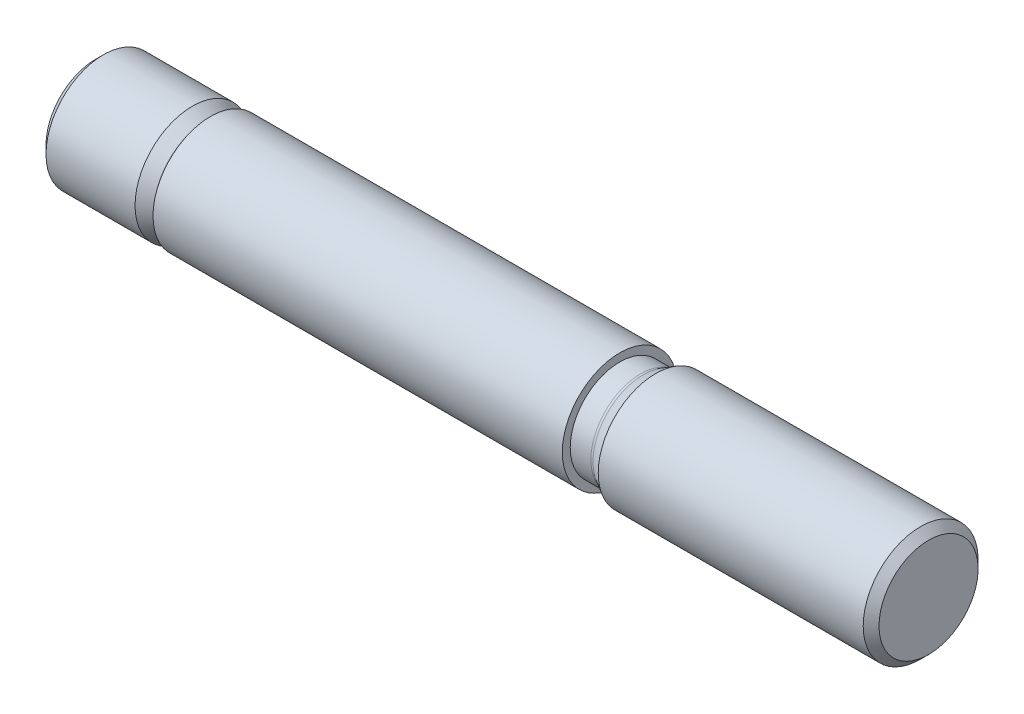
ISO-10303-21;
HEADER;
FILE_DESCRIPTION(('STEP AP214'),'2;1');
FILE_NAME('part.step','',(''),(''),'','','');
FILE_SCHEMA(('AUTOMOTIVE_DESIGN { 1 0 10303 214 1 1 1 1 }'));
ENDSEC;
DATA;
#1=APPLICATION_CONTEXT('core data for automotive mechanical design processes');
#2=APPLICATION_PROTOCOL_DEFINITION('international standard','automotive_design',2000,#1);
#3=PRODUCT_CONTEXT('',#1,'mechanical');
#4=PRODUCT('Part','Part','',(#3));
#5=PRODUCT_RELATED_PRODUCT_CATEGORY('part','',(#4));
#6=PRODUCT_DEFINITION_FORMATION('','',#4);
#7=PRODUCT_DEFINITION_CONTEXT('part definition',#1,'design');
#8=PRODUCT_DEFINITION('design','',#6,#7);
#9=PRODUCT_DEFINITION_SHAPE('','',#8);
#10=(LENGTH_UNIT() NAMED_UNIT(*) SI_UNIT(.MILLI.,.METRE.));
#11=(NAMED_UNIT(*) PLANE_ANGLE_UNIT() SI_UNIT($,.RADIAN.));
#12=(NAMED_UNIT(*) SI_UNIT($,.STERADIAN.) SOLID_ANGLE_UNIT());
#13=UNCERTAINTY_MEASURE_WITH_UNIT(LENGTH_MEASURE(1.E-05),#10,'distance_accuracy_value','');
#14=(GEOMETRIC_REPRESENTATION_CONTEXT(3) GLOBAL_UNCERTAINTY_ASSIGNED_CONTEXT((#13)) GLOBAL_UNIT_ASSIGNED_CONTEXT((#10,
#11,#12)) REPRESENTATION_CONTEXT('',''));
#15=CARTESIAN_POINT('',(0.,0.,0.));
#16=DIRECTION('',(0.,0.,1.));
#17=DIRECTION('',(1.,0.,0.));
#18=AXIS2_PLACEMENT_3D('',#15,#16,#17);
#19=CARTESIAN_POINT('',(0.,6.8985,0.));
#20=DIRECTION('',(1.,0.,0.));
#21=DIRECTION('',(0.,0.,-1.));
#22=AXIS2_PLACEMENT_3D('',#19,#20,#21);
#23=PLANE('',#22);
#24=CARTESIAN_POINT('',(0.,0.,0.));
#25=DIRECTION('',(-1.,0.,0.));
#26=DIRECTION('',(0.,0.,1.));
#27=AXIS2_PLACEMENT_3D('',#24,#25,#26);
#28=CIRCLE('',#27,6.8985);
#29=CARTESIAN_POINT('',(0.,0.,6.8985));
#30=VERTEX_POINT('',#29);
#31=EDGE_CURVE('E83',#30,#30,#28,.T.);
#32=ORIENTED_EDGE('',*,*,#31,.T.);
#33=EDGE_LOOP('',(#32));
#34=FACE_BOUND('',#33,.T.);
#35=ADVANCED_FACE('F39',(#34),#23,.F.);
#36=CARTESIAN_POINT('',(116.,6.8985,0.));
#37=DIRECTION('',(1.,0.,0.));
#38=DIRECTION('',(0.,0.,-1.));
#39=AXIS2_PLACEMENT_3D('',#36,#37,#38);
#40=PLANE('',#39);
#41=CARTESIAN_POINT('',(116.,0.,0.));
#42=DIRECTION('',(-1.,0.,0.));
#43=DIRECTION('',(0.,0.,1.));
#44=AXIS2_PLACEMENT_3D('',#41,#42,#43);
#45=CIRCLE('',#44,6.8985);
#46=CARTESIAN_POINT('',(116.,0.,6.8985));
#47=VERTEX_POINT('',#46);
#48=EDGE_CURVE('E10',#47,#47,#45,.T.);
#49=ORIENTED_EDGE('',*,*,#48,.F.);
#50=EDGE_LOOP('',(#49));
#51=FACE_BOUND('',#50,.T.);
#52=ADVANCED_FACE('F136',(#51),#40,.T.);
#53=CARTESIAN_POINT('',(114.8985,0.,0.));
#54=DIRECTION('',(-1.,0.,0.));
#55=DIRECTION('',(0.,0.,1.));
#56=AXIS2_PLACEMENT_3D('',#53,#54,#55);
#57=CONICAL_SURFACE('',#56,8.,0.785398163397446);
#58=ORIENTED_EDGE('',*,*,#48,.T.);
#59=EDGE_LOOP('',(#58));
#60=FACE_BOUND('',#59,.T.);
#61=CARTESIAN_POINT('',(114.8985,0.,0.));
#62=DIRECTION('',(-1.,0.,0.));
#63=DIRECTION('',(0.,0.,1.));
#64=AXIS2_PLACEMENT_3D('',#61,#62,#63);
#65=CIRCLE('',#64,8.);
#66=CARTESIAN_POINT('',(114.8985,0.,8.));
#67=VERTEX_POINT('',#66);
#68=EDGE_CURVE('E44',#67,#67,#65,.T.);
#69=ORIENTED_EDGE('',*,*,#68,.F.);
#70=EDGE_LOOP('',(#69));
#71=FACE_BOUND('',#70,.T.);
#72=ADVANCED_FACE('F145',(#60,#71),#57,.T.);
#73=CARTESIAN_POINT('',(-14.6577084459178,0.,0.));
#74=DIRECTION('',(-1.,0.,0.));
#75=DIRECTION('',(0.,0.,1.));
#76=AXIS2_PLACEMENT_3D('',#73,#74,#75);
#77=CYLINDRICAL_SURFACE('',#76,8.);
#78=ORIENTED_EDGE('',*,*,#68,.T.);
#79=EDGE_LOOP('',(#78));
#80=FACE_BOUND('',#79,.T.);
#81=CARTESIAN_POINT('',(78.,0.,0.));
#82=DIRECTION('',(-1.,0.,0.));
#83=DIRECTION('',(0.,0.,1.));
#84=AXIS2_PLACEMENT_3D('',#81,#82,#83);
#85=CIRCLE('',#84,8.);
#86=CARTESIAN_POINT('',(78.,0.,8.));
#87=VERTEX_POINT('',#86);
#88=EDGE_CURVE('E47',#87,#87,#85,.T.);
#89=ORIENTED_EDGE('',*,*,#88,.F.);
#90=EDGE_LOOP('',(#89));
#91=FACE_BOUND('',#90,.T.);
#92=ADVANCED_FACE('F150',(#80,#91),#77,.T.);
#93=CARTESIAN_POINT('',(76.277786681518,0.,0.));
#94=DIRECTION('',(1.,0.,0.));
#95=DIRECTION('',(0.,0.,-1.));
#96=AXIS2_PLACEMENT_3D('',#93,#94,#95);
#97=CONICAL_SURFACE('',#96,7.00567967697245,0.523598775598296);
#98=ORIENTED_EDGE('',*,*,#88,.T.);
#99=EDGE_LOOP('',(#98));
#100=FACE_BOUND('',#99,.T.);
#101=CARTESIAN_POINT('',(76.277786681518,0.,0.));
#102=DIRECTION('',(-1.,0.,0.));
#103=DIRECTION('',(0.,0.,1.));
#104=AXIS2_PLACEMENT_3D('',#101,#102,#103);
#105=CIRCLE('',#104,7.00567967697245);
#106=CARTESIAN_POINT('',(76.277786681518,0.,7.00567967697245));
#107=VERTEX_POINT('',#106);
#108=EDGE_CURVE('E52',#107,#107,#105,.T.);
#109=ORIENTED_EDGE('',*,*,#108,.F.);
#110=EDGE_LOOP('',(#109));
#111=FACE_BOUND('',#110,.T.);
#112=ADVANCED_FACE('F155',(#100,#111),#97,.T.);
#113=CARTESIAN_POINT('',(75.877786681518,0.,0.));
#114=DIRECTION('',(-1.,0.,0.));
#115=DIRECTION('',(0.,0.,1.));
#116=AXIS2_PLACEMENT_3D('',#113,#114,#115);
#117=TOROIDAL_SURFACE('',#116,7.6985,0.800000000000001);
#118=ORIENTED_EDGE('',*,*,#108,.T.);
#119=EDGE_LOOP('',(#118));
#120=FACE_BOUND('',#119,.T.);
#121=CARTESIAN_POINT('',(75.877786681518,0.,0.));
#122=DIRECTION('',(-1.,0.,0.));
#123=DIRECTION('',(0.,0.,1.));
#124=AXIS2_PLACEMENT_3D('',#121,#122,#123);
#125=CIRCLE('',#124,6.8985);
#126=CARTESIAN_POINT('',(75.877786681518,0.,6.8985));
#127=VERTEX_POINT('',#126);
#128=EDGE_CURVE('E59',#127,#127,#125,.T.);
#129=ORIENTED_EDGE('',*,*,#128,.F.);
#130=EDGE_LOOP('',(#129));
#131=FACE_BOUND('',#130,.T.);
#132=ADVANCED_FACE('F151',(#120,#131),#117,.F.);
#133=CARTESIAN_POINT('',(-14.6577084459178,0.,0.));
#134=DIRECTION('',(-1.,0.,0.));
#135=DIRECTION('',(0.,0.,1.));
#136=AXIS2_PLACEMENT_3D('',#133,#134,#135);
#137=CYLINDRICAL_SURFACE('',#136,6.8985);
#138=ORIENTED_EDGE('',*,*,#128,.T.);
#139=EDGE_LOOP('',(#138));
#140=FACE_BOUND('',#139,.T.);
#141=CARTESIAN_POINT('',(73.,0.,0.));
#142=DIRECTION('',(-1.,0.,0.));
#143=DIRECTION('',(0.,0.,1.));
#144=AXIS2_PLACEMENT_3D('',#141,#142,#143);
#145=CIRCLE('',#144,6.8985);
#146=CARTESIAN_POINT('',(73.,0.,6.8985));
#147=VERTEX_POINT('',#146);
#148=EDGE_CURVE('E62',#147,#147,#145,.T.);
#149=ORIENTED_EDGE('',*,*,#148,.F.);
#150=EDGE_LOOP('',(#149));
#151=FACE_BOUND('',#150,.T.);
#152=ADVANCED_FACE('F134',(#140,#151),#137,.T.);
#153=CARTESIAN_POINT('',(73.,8.,0.));
#154=DIRECTION('',(1.,0.,0.));
#155=DIRECTION('',(0.,0.,-1.));
#156=AXIS2_PLACEMENT_3D('',#153,#154,#155);
#157=PLANE('',#156);
#158=ORIENTED_EDGE('',*,*,#148,.T.);
#159=EDGE_LOOP('',(#158));
#160=FACE_BOUND('',#159,.T.);
#161=CARTESIAN_POINT('',(73.,0.,0.));
#162=DIRECTION('',(-1.,0.,0.));
#163=DIRECTION('',(0.,0.,1.));
#164=AXIS2_PLACEMENT_3D('',#161,#162,#163);
#165=CIRCLE('',#164,8.);
#166=CARTESIAN_POINT('',(73.,0.,8.));
#167=VERTEX_POINT('',#166);
#168=EDGE_CURVE('E61',#167,#167,#165,.T.);
#169=ORIENTED_EDGE('',*,*,#168,.F.);
#170=EDGE_LOOP('',(#169));
#171=FACE_BOUND('',#170,.T.);
#172=ADVANCED_FACE('F129',(#160,#171),#157,.T.);
#173=CARTESIAN_POINT('',(-14.6577084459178,0.,0.));
#174=DIRECTION('',(-1.,0.,0.));
#175=DIRECTION('',(0.,0.,1.));
#176=AXIS2_PLACEMENT_3D('',#173,#174,#175);
#177=CYLINDRICAL_SURFACE('',#176,8.);
#178=ORIENTED_EDGE('',*,*,#168,.T.);
#179=EDGE_LOOP('',(#178));
#180=FACE_BOUND('',#179,.T.);
#181=CARTESIAN_POINT('',(16.,0.,0.));
#182=DIRECTION('',(-1.,0.,0.));
#183=DIRECTION('',(0.,0.,1.));
#184=AXIS2_PLACEMENT_3D('',#181,#182,#183);
#185=CIRCLE('',#184,8.);
#186=CARTESIAN_POINT('',(16.,0.,8.));
#187=VERTEX_POINT('',#186);
#188=EDGE_CURVE('E70',#187,#187,#185,.T.);
#189=ORIENTED_EDGE('',*,*,#188,.F.);
#190=EDGE_LOOP('',(#189));
#191=FACE_BOUND('',#190,.T.);
#192=ADVANCED_FACE('F124',(#180,#191),#177,.T.);
#193=CARTESIAN_POINT('',(16.,8.,0.));
#194=DIRECTION('',(1.,0.,0.));
#195=DIRECTION('',(0.,0.,-1.));
#196=AXIS2_PLACEMENT_3D('',#193,#194,#195);
#197=PLANE('',#196);
#198=CARTESIAN_POINT('',(16.,0.,0.));
#199=DIRECTION('',(-1.,0.,0.));
#200=DIRECTION('',(0.,0.,1.));
#201=AXIS2_PLACEMENT_3D('',#198,#199,#200);
#202=CIRCLE('',#201,6.8985);
#203=CARTESIAN_POINT('',(16.,0.,6.8985));
#204=VERTEX_POINT('',#203);
#205=EDGE_CURVE('E66',#204,#204,#202,.T.);
#206=ORIENTED_EDGE('',*,*,#205,.F.);
#207=EDGE_LOOP('',(#206));
#208=FACE_BOUND('',#207,.T.);
#209=ORIENTED_EDGE('',*,*,#188,.T.);
#210=EDGE_LOOP('',(#209));
#211=FACE_BOUND('',#210,.T.);
#212=ADVANCED_FACE('F120',(#208,#211),#197,.F.);
#213=CARTESIAN_POINT('',(-14.6577084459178,0.,0.));
#214=DIRECTION('',(-1.,0.,0.));
#215=DIRECTION('',(0.,0.,1.));
#216=AXIS2_PLACEMENT_3D('',#213,#214,#215);
#217=CYLINDRICAL_SURFACE('',#216,6.8985);
#218=CARTESIAN_POINT('',(15.622213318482,0.,0.));
#219=DIRECTION('',(-1.,0.,0.));
#220=DIRECTION('',(0.,0.,1.));
#221=AXIS2_PLACEMENT_3D('',#218,#219,#220);
#222=CIRCLE('',#221,6.8985);
#223=CARTESIAN_POINT('',(15.622213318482,0.,6.8985));
#224=VERTEX_POINT('',#223);
#225=EDGE_CURVE('E71',#224,#224,#222,.T.);
#226=ORIENTED_EDGE('',*,*,#225,.F.);
#227=EDGE_LOOP('',(#226));
#228=FACE_BOUND('',#227,.T.);
#229=ORIENTED_EDGE('',*,*,#205,.T.);
#230=EDGE_LOOP('',(#229));
#231=FACE_BOUND('',#230,.T.);
#232=ADVANCED_FACE('F111',(#228,#231),#217,.T.);
#233=CARTESIAN_POINT('',(15.622213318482,0.,0.));
#234=DIRECTION('',(-1.,0.,0.));
#235=DIRECTION('',(0.,0.,1.));
#236=AXIS2_PLACEMENT_3D('',#233,#234,#235);
#237=TOROIDAL_SURFACE('',#236,7.6985,0.8);
#238=CARTESIAN_POINT('',(15.222213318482,0.,0.));
#239=DIRECTION('',(-1.,0.,0.));
#240=DIRECTION('',(0.,0.,1.));
#241=AXIS2_PLACEMENT_3D('',#238,#239,#240);
#242=CIRCLE('',#241,7.00567967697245);
#243=CARTESIAN_POINT('',(15.222213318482,0.,7.00567967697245));
#244=VERTEX_POINT('',#243);
#245=EDGE_CURVE('E77',#244,#244,#242,.T.);
#246=ORIENTED_EDGE('',*,*,#245,.F.);
#247=EDGE_LOOP('',(#246));
#248=FACE_BOUND('',#247,.T.);
#249=ORIENTED_EDGE('',*,*,#225,.T.);
#250=EDGE_LOOP('',(#249));
#251=FACE_BOUND('',#250,.T.);
#252=ADVANCED_FACE('F102',(#248,#251),#237,.F.);
#253=CARTESIAN_POINT('',(15.222213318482,0.,0.));
#254=DIRECTION('',(-1.,0.,0.));
#255=DIRECTION('',(0.,0.,1.));
#256=AXIS2_PLACEMENT_3D('',#253,#254,#255);
#257=CONICAL_SURFACE('',#256,7.00567967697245,0.523598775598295);
#258=CARTESIAN_POINT('',(13.5,0.,0.));
#259=DIRECTION('',(-1.,0.,0.));
#260=DIRECTION('',(0.,0.,1.));
#261=AXIS2_PLACEMENT_3D('',#258,#259,#260);
#262=CIRCLE('',#261,8.);
#263=CARTESIAN_POINT('',(13.5,0.,8.));
#264=VERTEX_POINT('',#263);
#265=EDGE_CURVE('E79',#264,#264,#262,.T.);
#266=ORIENTED_EDGE('',*,*,#265,.F.);
#267=EDGE_LOOP('',(#266));
#268=FACE_BOUND('',#267,.T.);
#269=ORIENTED_EDGE('',*,*,#245,.T.);
#270=EDGE_LOOP('',(#269));
#271=FACE_BOUND('',#270,.T.);
#272=ADVANCED_FACE('F100',(#268,#271),#257,.T.);
#273=CARTESIAN_POINT('',(-14.6577084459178,0.,0.));
#274=DIRECTION('',(-1.,0.,0.));
#275=DIRECTION('',(0.,0.,1.));
#276=AXIS2_PLACEMENT_3D('',#273,#274,#275);
#277=CYLINDRICAL_SURFACE('',#276,8.);
#278=CARTESIAN_POINT('',(1.10149999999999,0.,0.));
#279=DIRECTION('',(-1.,0.,0.));
#280=DIRECTION('',(0.,0.,1.));
#281=AXIS2_PLACEMENT_3D('',#278,#279,#280);
#282=CIRCLE('',#281,8.);
#283=CARTESIAN_POINT('',(1.10149999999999,0.,8.));
#284=VERTEX_POINT('',#283);
#285=EDGE_CURVE('E85',#284,#284,#282,.T.);
#286=ORIENTED_EDGE('',*,*,#285,.F.);
#287=EDGE_LOOP('',(#286));
#288=FACE_BOUND('',#287,.T.);
#289=ORIENTED_EDGE('',*,*,#265,.T.);
#290=EDGE_LOOP('',(#289));
#291=FACE_BOUND('',#290,.T.);
#292=ADVANCED_FACE('F91',(#288,#291),#277,.T.);
#293=CARTESIAN_POINT('',(1.10149999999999,0.,0.));
#294=DIRECTION('',(1.,0.,0.));
#295=DIRECTION('',(0.,0.,-1.));
#296=AXIS2_PLACEMENT_3D('',#293,#294,#295);
#297=CONICAL_SURFACE('',#296,8.,0.78539816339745);
#298=ORIENTED_EDGE('',*,*,#31,.F.);
#299=EDGE_LOOP('',(#298));
#300=FACE_BOUND('',#299,.T.);
#301=ORIENTED_EDGE('',*,*,#285,.T.);
#302=EDGE_LOOP('',(#301));
#303=FACE_BOUND('',#302,.T.);
#304=ADVANCED_FACE('F86',(#300,#303),#297,.T.);
#305=CLOSED_SHELL('',(#35,#52,#72,#92,#112,#132,#152,#172,#192,#212,#232,#252,#272,#292,#304));
#306=MANIFOLD_SOLID_BREP('B2',#305);
#307=ADVANCED_BREP_SHAPE_REPRESENTATION('',(#18,#306),#14);
#308=SHAPE_DEFINITION_REPRESENTATION(#9,#307);
ENDSEC;
END-ISO-10303-21;
